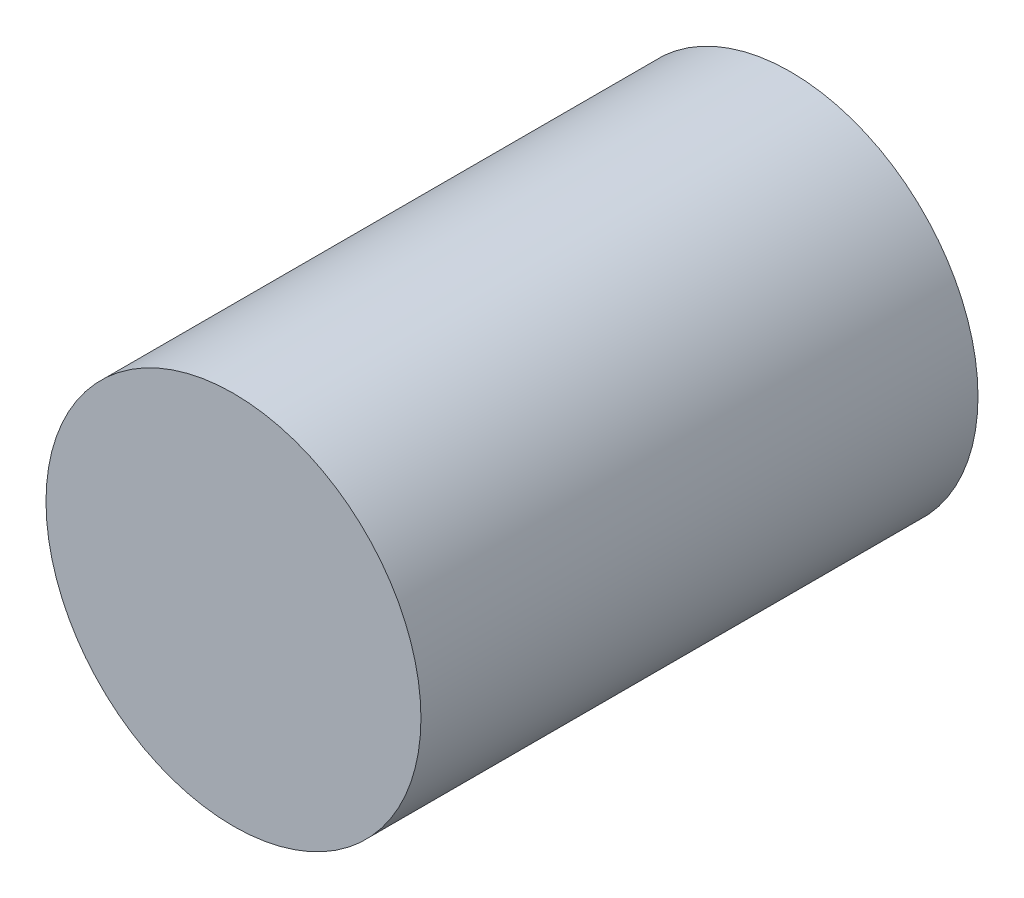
from build123d import *

# Parameters (mm, degrees)
SKETCH_1_R      = 17.5
EXTRUDE_1_DEPTH = 52
SKETCH_2_R      = 1
EXTRUDE_2_DEPTH = 6


with BuildPart() as part:
    # Sketch 1 → Extrude 1 (new body)
    with BuildSketch(Plane.XY):
        with Locations(Location((0, 0, 0), (0, 0, 180))):
            Circle(SKETCH_1_R)
    extrude(amount=EXTRUDE_1_DEPTH)

    # Sketch 2 → Extrude 2 (add)
    with BuildSketch(Plane(origin=(0, 0, 0), x_dir=(-1, 0, 0), z_dir=(0, 0, -1))):
        with Locations(Location((0, 5, 0), (0, 0, 180))):
            Circle(SKETCH_2_R)
        with Locations(Location((0, -5, 0), (0, 0, 180))):
            Circle(SKETCH_2_R)
    extrude(amount=EXTRUDE_2_DEPTH)


solid = part.part
